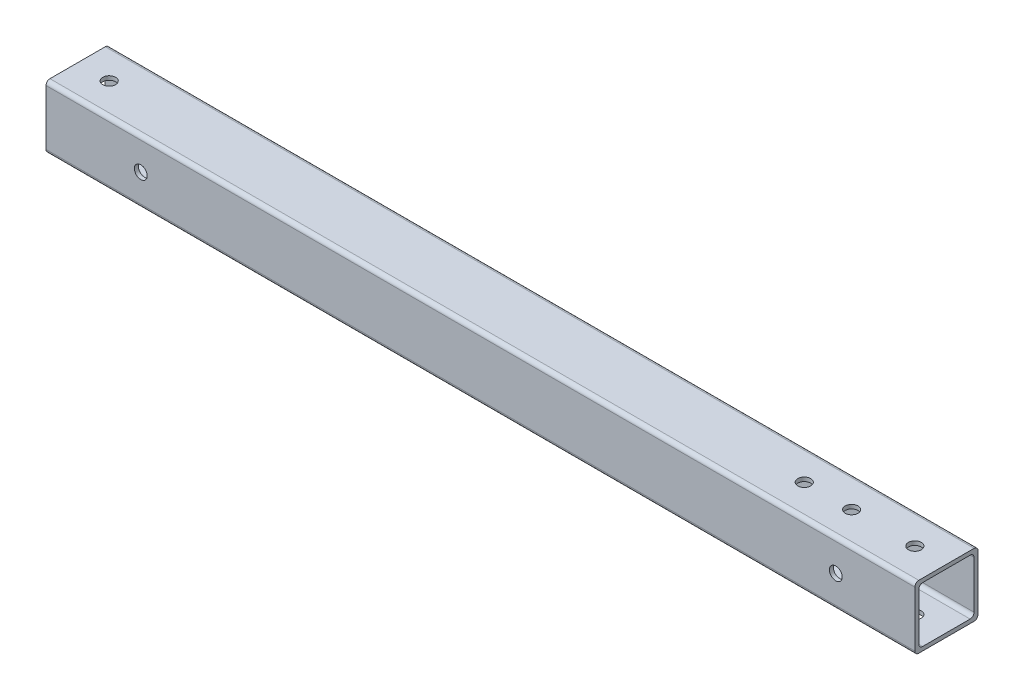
ISO-10303-21;
HEADER;
FILE_DESCRIPTION(('STEP AP214'),'2;1');
FILE_NAME('part.step','',(''),(''),'','','');
FILE_SCHEMA(('AUTOMOTIVE_DESIGN { 1 0 10303 214 1 1 1 1 }'));
ENDSEC;
DATA;
#1=APPLICATION_CONTEXT('core data for automotive mechanical design processes');
#2=APPLICATION_PROTOCOL_DEFINITION('international standard','automotive_design',2000,#1);
#3=PRODUCT_CONTEXT('',#1,'mechanical');
#4=PRODUCT('Part','Part','',(#3));
#5=PRODUCT_RELATED_PRODUCT_CATEGORY('part','',(#4));
#6=PRODUCT_DEFINITION_FORMATION('','',#4);
#7=PRODUCT_DEFINITION_CONTEXT('part definition',#1,'design');
#8=PRODUCT_DEFINITION('design','',#6,#7);
#9=PRODUCT_DEFINITION_SHAPE('','',#8);
#10=(LENGTH_UNIT() NAMED_UNIT(*) SI_UNIT(.MILLI.,.METRE.));
#11=(NAMED_UNIT(*) PLANE_ANGLE_UNIT() SI_UNIT($,.RADIAN.));
#12=(NAMED_UNIT(*) SI_UNIT($,.STERADIAN.) SOLID_ANGLE_UNIT());
#13=UNCERTAINTY_MEASURE_WITH_UNIT(LENGTH_MEASURE(1.E-05),#10,'distance_accuracy_value','');
#14=(GEOMETRIC_REPRESENTATION_CONTEXT(3) GLOBAL_UNCERTAINTY_ASSIGNED_CONTEXT((#13)) GLOBAL_UNIT_ASSIGNED_CONTEXT((#10,
#11,#12)) REPRESENTATION_CONTEXT('',''));
#15=CARTESIAN_POINT('',(0.,0.,0.));
#16=DIRECTION('',(0.,0.,1.));
#17=DIRECTION('',(1.,0.,0.));
#18=AXIS2_PLACEMENT_3D('',#15,#16,#17);
#19=CARTESIAN_POINT('',(0.,101.6,0.));
#20=DIRECTION('',(-1.,0.,0.));
#21=DIRECTION('',(0.,0.,1.));
#22=AXIS2_PLACEMENT_3D('',#19,#20,#21);
#23=PLANE('',#22);
#24=DIRECTION('',(0.,0.,1.));
#25=VECTOR('',#24,1.);
#26=CARTESIAN_POINT('',(0.,95.25,6.35000000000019));
#27=LINE('',#26,#25);
#28=CARTESIAN_POINT('',(0.,95.25,12.7000000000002));
#29=VERTEX_POINT('',#28);
#30=CARTESIAN_POINT('',(0.,95.25,88.9000000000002));
#31=VERTEX_POINT('',#30);
#32=EDGE_CURVE('E169',#29,#31,#27,.T.);
#33=ORIENTED_EDGE('',*,*,#32,.F.);
#34=CARTESIAN_POINT('',(0.,88.9,12.7000000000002));
#35=DIRECTION('',(-1.,0.,0.));
#36=DIRECTION('',(0.,0.,1.));
#37=AXIS2_PLACEMENT_3D('',#34,#35,#36);
#38=CIRCLE('',#37,6.35);
#39=CARTESIAN_POINT('',(0.,88.9,6.35000000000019));
#40=VERTEX_POINT('',#39);
#41=EDGE_CURVE('E179',#29,#40,#38,.T.);
#42=ORIENTED_EDGE('',*,*,#41,.T.);
#43=DIRECTION('',(0.,1.,0.));
#44=VECTOR('',#43,1.);
#45=CARTESIAN_POINT('',(0.,95.25,6.35000000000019));
#46=LINE('',#45,#44);
#47=CARTESIAN_POINT('',(0.,12.7,6.3500000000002));
#48=VERTEX_POINT('',#47);
#49=EDGE_CURVE('E252',#48,#40,#46,.T.);
#50=ORIENTED_EDGE('',*,*,#49,.F.);
#51=CARTESIAN_POINT('',(0.,12.7,12.7000000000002));
#52=DIRECTION('',(-1.,0.,0.));
#53=DIRECTION('',(0.,0.,1.));
#54=AXIS2_PLACEMENT_3D('',#51,#52,#53);
#55=CIRCLE('',#54,6.35);
#56=CARTESIAN_POINT('',(0.,6.35,12.7000000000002));
#57=VERTEX_POINT('',#56);
#58=EDGE_CURVE('E11',#48,#57,#55,.T.);
#59=ORIENTED_EDGE('',*,*,#58,.T.);
#60=DIRECTION('',(0.,0.,-1.));
#61=VECTOR('',#60,1.);
#62=CARTESIAN_POINT('',(0.,6.35,6.35000000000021));
#63=LINE('',#62,#61);
#64=CARTESIAN_POINT('',(0.,6.35,88.9000000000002));
#65=VERTEX_POINT('',#64);
#66=EDGE_CURVE('E265',#65,#57,#63,.T.);
#67=ORIENTED_EDGE('',*,*,#66,.F.);
#68=CARTESIAN_POINT('',(0.,12.7,88.9000000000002));
#69=DIRECTION('',(-1.,0.,0.));
#70=DIRECTION('',(0.,0.,1.));
#71=AXIS2_PLACEMENT_3D('',#68,#69,#70);
#72=CIRCLE('',#71,6.35);
#73=CARTESIAN_POINT('',(0.,12.7,95.2500000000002));
#74=VERTEX_POINT('',#73);
#75=EDGE_CURVE('E168',#65,#74,#72,.T.);
#76=ORIENTED_EDGE('',*,*,#75,.T.);
#77=DIRECTION('',(0.,-1.,0.));
#78=VECTOR('',#77,1.);
#79=CARTESIAN_POINT('',(0.,95.25,95.2500000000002));
#80=LINE('',#79,#78);
#81=CARTESIAN_POINT('',(0.,88.9,95.2500000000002));
#82=VERTEX_POINT('',#81);
#83=EDGE_CURVE('E152',#82,#74,#80,.T.);
#84=ORIENTED_EDGE('',*,*,#83,.F.);
#85=CARTESIAN_POINT('',(0.,88.9,88.9000000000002));
#86=DIRECTION('',(-1.,0.,0.));
#87=DIRECTION('',(0.,0.,1.));
#88=AXIS2_PLACEMENT_3D('',#85,#86,#87);
#89=CIRCLE('',#88,6.35);
#90=EDGE_CURVE('E164',#82,#31,#89,.T.);
#91=ORIENTED_EDGE('',*,*,#90,.T.);
#92=EDGE_LOOP('',(#33,#42,#50,#59,#67,#76,#84,#91));
#93=FACE_BOUND('',#92,.T.);
#94=DIRECTION('',(0.,-1.,0.));
#95=VECTOR('',#94,1.);
#96=CARTESIAN_POINT('',(0.,101.6,101.6));
#97=LINE('',#96,#95);
#98=CARTESIAN_POINT('',(0.,95.25,101.6));
#99=VERTEX_POINT('',#98);
#100=CARTESIAN_POINT('',(0.,6.34999999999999,101.6));
#101=VERTEX_POINT('',#100);
#102=EDGE_CURVE('E276',#99,#101,#97,.T.);
#103=ORIENTED_EDGE('',*,*,#102,.T.);
#104=CARTESIAN_POINT('',(0.,6.34999999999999,95.25));
#105=DIRECTION('',(-1.,0.,0.));
#106=DIRECTION('',(0.,0.,1.));
#107=AXIS2_PLACEMENT_3D('',#104,#105,#106);
#108=CIRCLE('',#107,6.35);
#109=CARTESIAN_POINT('',(0.,0.,95.25));
#110=VERTEX_POINT('',#109);
#111=EDGE_CURVE('E307',#101,#110,#108,.F.);
#112=ORIENTED_EDGE('',*,*,#111,.T.);
#113=DIRECTION('',(0.,0.,-1.));
#114=VECTOR('',#113,1.);
#115=CARTESIAN_POINT('',(0.,0.,0.));
#116=LINE('',#115,#114);
#117=CARTESIAN_POINT('',(0.,0.,6.35));
#118=VERTEX_POINT('',#117);
#119=EDGE_CURVE('E268',#110,#118,#116,.T.);
#120=ORIENTED_EDGE('',*,*,#119,.T.);
#121=CARTESIAN_POINT('',(0.,6.34999999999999,6.35));
#122=DIRECTION('',(-1.,0.,0.));
#123=DIRECTION('',(0.,0.,1.));
#124=AXIS2_PLACEMENT_3D('',#121,#122,#123);
#125=CIRCLE('',#124,6.35);
#126=CARTESIAN_POINT('',(0.,6.34999999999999,0.));
#127=VERTEX_POINT('',#126);
#128=EDGE_CURVE('E301',#118,#127,#125,.F.);
#129=ORIENTED_EDGE('',*,*,#128,.T.);
#130=DIRECTION('',(0.,-1.,0.));
#131=VECTOR('',#130,1.);
#132=CARTESIAN_POINT('',(0.,101.6,0.));
#133=LINE('',#132,#131);
#134=CARTESIAN_POINT('',(0.,95.25,0.));
#135=VERTEX_POINT('',#134);
#136=EDGE_CURVE('E159',#135,#127,#133,.T.);
#137=ORIENTED_EDGE('',*,*,#136,.F.);
#138=CARTESIAN_POINT('',(0.,95.25,6.35));
#139=DIRECTION('',(-1.,0.,0.));
#140=DIRECTION('',(0.,0.,1.));
#141=AXIS2_PLACEMENT_3D('',#138,#139,#140);
#142=CIRCLE('',#141,6.35);
#143=CARTESIAN_POINT('',(0.,101.6,6.35));
#144=VERTEX_POINT('',#143);
#145=EDGE_CURVE('E303',#135,#144,#142,.F.);
#146=ORIENTED_EDGE('',*,*,#145,.T.);
#147=DIRECTION('',(0.,0.,-1.));
#148=VECTOR('',#147,1.);
#149=CARTESIAN_POINT('',(0.,101.6,0.));
#150=LINE('',#149,#148);
#151=CARTESIAN_POINT('',(0.,101.6,95.25));
#152=VERTEX_POINT('',#151);
#153=EDGE_CURVE('E269',#152,#144,#150,.T.);
#154=ORIENTED_EDGE('',*,*,#153,.F.);
#155=CARTESIAN_POINT('',(0.,95.25,95.25));
#156=DIRECTION('',(-1.,0.,0.));
#157=DIRECTION('',(0.,0.,1.));
#158=AXIS2_PLACEMENT_3D('',#155,#156,#157);
#159=CIRCLE('',#158,6.35);
#160=EDGE_CURVE('E305',#152,#99,#159,.F.);
#161=ORIENTED_EDGE('',*,*,#160,.T.);
#162=EDGE_LOOP('',(#103,#112,#120,#129,#137,#146,#154,#161));
#163=FACE_BOUND('',#162,.T.);
#164=ADVANCED_FACE('F31',(#93,#163),#23,.F.);
#165=CARTESIAN_POINT('',(0.,101.6,0.));
#166=DIRECTION('',(0.,0.,1.));
#167=DIRECTION('',(1.,0.,0.));
#168=AXIS2_PLACEMENT_3D('',#165,#166,#167);
#169=PLANE('',#168);
#170=CARTESIAN_POINT('',(-127.,50.8,0.));
#171=DIRECTION('',(0.,0.,-1.));
#172=DIRECTION('',(-1.,0.,0.));
#173=AXIS2_PLACEMENT_3D('',#170,#171,#172);
#174=CIRCLE('',#173,10.31875);
#175=CARTESIAN_POINT('',(-137.31875,50.8,0.));
#176=VERTEX_POINT('',#175);
#177=EDGE_CURVE('E230',#176,#176,#174,.T.);
#178=ORIENTED_EDGE('',*,*,#177,.F.);
#179=EDGE_LOOP('',(#178));
#180=FACE_BOUND('',#179,.T.);
#181=CARTESIAN_POINT('',(-1244.6,50.8,1.52414506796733E-13));
#182=DIRECTION('',(0.,0.,-1.));
#183=DIRECTION('',(-1.,0.,0.));
#184=AXIS2_PLACEMENT_3D('',#181,#182,#183);
#185=CIRCLE('',#184,10.31875);
#186=CARTESIAN_POINT('',(-1254.91875,50.8,1.53678147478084E-13));
#187=VERTEX_POINT('',#186);
#188=EDGE_CURVE('E237',#187,#187,#185,.T.);
#189=ORIENTED_EDGE('',*,*,#188,.F.);
#190=EDGE_LOOP('',(#189));
#191=FACE_BOUND('',#190,.T.);
#192=DIRECTION('',(0.,-1.,0.));
#193=VECTOR('',#192,1.);
#194=CARTESIAN_POINT('',(-1397.,101.6,1.71077507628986E-13));
#195=LINE('',#194,#193);
#196=CARTESIAN_POINT('',(-1397.,95.25,1.71077507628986E-13));
#197=VERTEX_POINT('',#196);
#198=CARTESIAN_POINT('',(-1397.,6.34999999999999,1.71077507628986E-13));
#199=VERTEX_POINT('',#198);
#200=EDGE_CURVE('E286',#197,#199,#195,.T.);
#201=ORIENTED_EDGE('',*,*,#200,.F.);
#202=DIRECTION('',(-1.,0.,0.));
#203=VECTOR('',#202,1.);
#204=CARTESIAN_POINT('',(0.,95.25,0.));
#205=LINE('',#204,#203);
#206=EDGE_CURVE('E335',#197,#135,#205,.F.);
#207=ORIENTED_EDGE('',*,*,#206,.T.);
#208=ORIENTED_EDGE('',*,*,#136,.T.);
#209=DIRECTION('',(-1.,0.,0.));
#210=VECTOR('',#209,1.);
#211=CARTESIAN_POINT('',(-1397.,6.34999999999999,1.71077507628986E-13));
#212=LINE('',#211,#210);
#213=EDGE_CURVE('E333',#127,#199,#212,.T.);
#214=ORIENTED_EDGE('',*,*,#213,.T.);
#215=EDGE_LOOP('',(#201,#207,#208,#214));
#216=FACE_BOUND('',#215,.T.);
#217=ADVANCED_FACE('F361',(#180,#191,#216),#169,.F.);
#218=CARTESIAN_POINT('',(-1397.,101.6,1.71077507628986E-13));
#219=DIRECTION('',(1.,0.,0.));
#220=DIRECTION('',(0.,0.,-1.));
#221=AXIS2_PLACEMENT_3D('',#218,#219,#220);
#222=PLANE('',#221);
#223=DIRECTION('',(0.,0.,1.));
#224=VECTOR('',#223,1.);
#225=CARTESIAN_POINT('',(-1397.,6.35,6.35000000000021));
#226=LINE('',#225,#224);
#227=CARTESIAN_POINT('',(-1397.,6.35,12.7000000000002));
#228=VERTEX_POINT('',#227);
#229=CARTESIAN_POINT('',(-1397.,6.35,88.9000000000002));
#230=VERTEX_POINT('',#229);
#231=EDGE_CURVE('E258',#228,#230,#226,.T.);
#232=ORIENTED_EDGE('',*,*,#231,.F.);
#233=CARTESIAN_POINT('',(-1397.,12.7,12.7000000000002));
#234=DIRECTION('',(1.,0.,0.));
#235=DIRECTION('',(0.,0.,-1.));
#236=AXIS2_PLACEMENT_3D('',#233,#234,#235);
#237=CIRCLE('',#236,6.35);
#238=CARTESIAN_POINT('',(-1397.,12.7,6.3500000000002));
#239=VERTEX_POINT('',#238);
#240=EDGE_CURVE('E40',#228,#239,#237,.T.);
#241=ORIENTED_EDGE('',*,*,#240,.T.);
#242=DIRECTION('',(0.,-1.,0.));
#243=VECTOR('',#242,1.);
#244=CARTESIAN_POINT('',(-1397.,95.25,6.35000000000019));
#245=LINE('',#244,#243);
#246=CARTESIAN_POINT('',(-1397.,88.9,6.35000000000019));
#247=VERTEX_POINT('',#246);
#248=EDGE_CURVE('E255',#247,#239,#245,.T.);
#249=ORIENTED_EDGE('',*,*,#248,.F.);
#250=CARTESIAN_POINT('',(-1397.,88.9,12.7000000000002));
#251=DIRECTION('',(1.,0.,0.));
#252=DIRECTION('',(0.,0.,-1.));
#253=AXIS2_PLACEMENT_3D('',#250,#251,#252);
#254=CIRCLE('',#253,6.35);
#255=CARTESIAN_POINT('',(-1397.,95.25,12.7000000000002));
#256=VERTEX_POINT('',#255);
#257=EDGE_CURVE('E176',#247,#256,#254,.T.);
#258=ORIENTED_EDGE('',*,*,#257,.T.);
#259=DIRECTION('',(0.,0.,-1.));
#260=VECTOR('',#259,1.);
#261=CARTESIAN_POINT('',(-1397.,95.25,6.35000000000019));
#262=LINE('',#261,#260);
#263=CARTESIAN_POINT('',(-1397.,95.25,88.9000000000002));
#264=VERTEX_POINT('',#263);
#265=EDGE_CURVE('E262',#264,#256,#262,.T.);
#266=ORIENTED_EDGE('',*,*,#265,.F.);
#267=CARTESIAN_POINT('',(-1397.,88.9,88.9000000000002));
#268=DIRECTION('',(1.,0.,0.));
#269=DIRECTION('',(0.,0.,-1.));
#270=AXIS2_PLACEMENT_3D('',#267,#268,#269);
#271=CIRCLE('',#270,6.35);
#272=CARTESIAN_POINT('',(-1397.,88.9,95.2500000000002));
#273=VERTEX_POINT('',#272);
#274=EDGE_CURVE('E177',#264,#273,#271,.T.);
#275=ORIENTED_EDGE('',*,*,#274,.T.);
#276=DIRECTION('',(0.,1.,0.));
#277=VECTOR('',#276,1.);
#278=CARTESIAN_POINT('',(-1397.,95.25,95.2500000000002));
#279=LINE('',#278,#277);
#280=CARTESIAN_POINT('',(-1397.,12.7,95.2500000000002));
#281=VERTEX_POINT('',#280);
#282=EDGE_CURVE('E155',#281,#273,#279,.T.);
#283=ORIENTED_EDGE('',*,*,#282,.F.);
#284=CARTESIAN_POINT('',(-1397.,12.7,88.9000000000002));
#285=DIRECTION('',(1.,0.,0.));
#286=DIRECTION('',(0.,0.,-1.));
#287=AXIS2_PLACEMENT_3D('',#284,#285,#286);
#288=CIRCLE('',#287,6.35);
#289=EDGE_CURVE('E337',#281,#230,#288,.T.);
#290=ORIENTED_EDGE('',*,*,#289,.T.);
#291=EDGE_LOOP('',(#232,#241,#249,#258,#266,#275,#283,#290));
#292=FACE_BOUND('',#291,.T.);
#293=DIRECTION('',(0.,0.,1.));
#294=VECTOR('',#293,1.);
#295=CARTESIAN_POINT('',(-1397.,0.,1.71077507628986E-13));
#296=LINE('',#295,#294);
#297=CARTESIAN_POINT('',(-1397.,0.,6.35000000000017));
#298=VERTEX_POINT('',#297);
#299=CARTESIAN_POINT('',(-1397.,0.,95.2500000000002));
#300=VERTEX_POINT('',#299);
#301=EDGE_CURVE('E273',#298,#300,#296,.T.);
#302=ORIENTED_EDGE('',*,*,#301,.T.);
#303=CARTESIAN_POINT('',(-1397.,6.34999999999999,95.2500000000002));
#304=DIRECTION('',(1.,0.,0.));
#305=DIRECTION('',(0.,0.,-1.));
#306=AXIS2_PLACEMENT_3D('',#303,#304,#305);
#307=CIRCLE('',#306,6.35);
#308=CARTESIAN_POINT('',(-1397.,6.34999999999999,101.6));
#309=VERTEX_POINT('',#308);
#310=EDGE_CURVE('E317',#300,#309,#307,.F.);
#311=ORIENTED_EDGE('',*,*,#310,.T.);
#312=DIRECTION('',(0.,-1.,0.));
#313=VECTOR('',#312,1.);
#314=CARTESIAN_POINT('',(-1397.,101.6,101.6));
#315=LINE('',#314,#313);
#316=CARTESIAN_POINT('',(-1397.,95.25,101.6));
#317=VERTEX_POINT('',#316);
#318=EDGE_CURVE('E283',#317,#309,#315,.T.);
#319=ORIENTED_EDGE('',*,*,#318,.F.);
#320=CARTESIAN_POINT('',(-1397.,95.25,95.2500000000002));
#321=DIRECTION('',(1.,0.,0.));
#322=DIRECTION('',(0.,0.,-1.));
#323=AXIS2_PLACEMENT_3D('',#320,#321,#322);
#324=CIRCLE('',#323,6.35);
#325=CARTESIAN_POINT('',(-1397.,101.6,95.2500000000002));
#326=VERTEX_POINT('',#325);
#327=EDGE_CURVE('E315',#317,#326,#324,.F.);
#328=ORIENTED_EDGE('',*,*,#327,.T.);
#329=DIRECTION('',(0.,0.,1.));
#330=VECTOR('',#329,1.);
#331=CARTESIAN_POINT('',(-1397.,101.6,1.71077507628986E-13));
#332=LINE('',#331,#330);
#333=CARTESIAN_POINT('',(-1397.,101.6,6.35000000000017));
#334=VERTEX_POINT('',#333);
#335=EDGE_CURVE('E272',#334,#326,#332,.T.);
#336=ORIENTED_EDGE('',*,*,#335,.F.);
#337=CARTESIAN_POINT('',(-1397.,95.25,6.35000000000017));
#338=DIRECTION('',(1.,0.,0.));
#339=DIRECTION('',(0.,0.,-1.));
#340=AXIS2_PLACEMENT_3D('',#337,#338,#339);
#341=CIRCLE('',#340,6.35);
#342=EDGE_CURVE('E56',#334,#197,#341,.F.);
#343=ORIENTED_EDGE('',*,*,#342,.T.);
#344=ORIENTED_EDGE('',*,*,#200,.T.);
#345=CARTESIAN_POINT('',(-1397.,6.34999999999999,6.35000000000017));
#346=DIRECTION('',(1.,0.,0.));
#347=DIRECTION('',(0.,0.,-1.));
#348=AXIS2_PLACEMENT_3D('',#345,#346,#347);
#349=CIRCLE('',#348,6.35);
#350=EDGE_CURVE('E48',#199,#298,#349,.F.);
#351=ORIENTED_EDGE('',*,*,#350,.T.);
#352=EDGE_LOOP('',(#302,#311,#319,#328,#336,#343,#344,#351));
#353=FACE_BOUND('',#352,.T.);
#354=ADVANCED_FACE('F340',(#292,#353),#222,.F.);
#355=CARTESIAN_POINT('',(0.,101.6,101.6));
#356=DIRECTION('',(0.,0.,-1.));
#357=DIRECTION('',(-1.,0.,0.));
#358=AXIS2_PLACEMENT_3D('',#355,#356,#357);
#359=PLANE('',#358);
#360=CARTESIAN_POINT('',(-127.,50.8,101.6));
#361=DIRECTION('',(0.,0.,-1.));
#362=DIRECTION('',(-1.,0.,0.));
#363=AXIS2_PLACEMENT_3D('',#360,#361,#362);
#364=CIRCLE('',#363,10.31875);
#365=CARTESIAN_POINT('',(-137.31875,50.8,101.6));
#366=VERTEX_POINT('',#365);
#367=EDGE_CURVE('E199',#366,#366,#364,.T.);
#368=ORIENTED_EDGE('',*,*,#367,.T.);
#369=EDGE_LOOP('',(#368));
#370=FACE_BOUND('',#369,.T.);
#371=CARTESIAN_POINT('',(-1244.6,50.8,101.6));
#372=DIRECTION('',(0.,0.,-1.));
#373=DIRECTION('',(-1.,0.,0.));
#374=AXIS2_PLACEMENT_3D('',#371,#372,#373);
#375=CIRCLE('',#374,10.31875);
#376=CARTESIAN_POINT('',(-1254.91875,50.8,101.6));
#377=VERTEX_POINT('',#376);
#378=EDGE_CURVE('E194',#377,#377,#375,.T.);
#379=ORIENTED_EDGE('',*,*,#378,.T.);
#380=EDGE_LOOP('',(#379));
#381=FACE_BOUND('',#380,.T.);
#382=ORIENTED_EDGE('',*,*,#318,.T.);
#383=DIRECTION('',(1.,0.,0.));
#384=VECTOR('',#383,1.);
#385=CARTESIAN_POINT('',(0.,6.34999999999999,101.6));
#386=LINE('',#385,#384);
#387=EDGE_CURVE('E298',#309,#101,#386,.T.);
#388=ORIENTED_EDGE('',*,*,#387,.T.);
#389=ORIENTED_EDGE('',*,*,#102,.F.);
#390=DIRECTION('',(1.,0.,0.));
#391=VECTOR('',#390,1.);
#392=CARTESIAN_POINT('',(0.,95.25,101.6));
#393=LINE('',#392,#391);
#394=EDGE_CURVE('E296',#99,#317,#393,.F.);
#395=ORIENTED_EDGE('',*,*,#394,.T.);
#396=EDGE_LOOP('',(#382,#388,#389,#395));
#397=FACE_BOUND('',#396,.T.);
#398=ADVANCED_FACE('F370',(#370,#381,#397),#359,.F.);
#399=CARTESIAN_POINT('',(0.,101.6,0.));
#400=DIRECTION('',(0.,-1.,0.));
#401=DIRECTION('',(0.,0.,-1.));
#402=AXIS2_PLACEMENT_3D('',#399,#400,#401);
#403=PLANE('',#402);
#404=CARTESIAN_POINT('',(-228.6,101.6,50.8));
#405=DIRECTION('',(0.,-1.,0.));
#406=DIRECTION('',(0.,0.,-1.));
#407=AXIS2_PLACEMENT_3D('',#404,#405,#406);
#408=CIRCLE('',#407,10.31875);
#409=CARTESIAN_POINT('',(-228.6,101.6,40.48125));
#410=VERTEX_POINT('',#409);
#411=EDGE_CURVE('E429',#410,#410,#408,.T.);
#412=ORIENTED_EDGE('',*,*,#411,.T.);
#413=EDGE_LOOP('',(#412));
#414=FACE_BOUND('',#413,.T.);
#415=CARTESIAN_POINT('',(-152.4,101.6,50.8));
#416=DIRECTION('',(0.,-1.,0.));
#417=DIRECTION('',(0.,0.,-1.));
#418=AXIS2_PLACEMENT_3D('',#415,#416,#417);
#419=CIRCLE('',#418,10.31875);
#420=CARTESIAN_POINT('',(-152.4,101.6,40.48125));
#421=VERTEX_POINT('',#420);
#422=EDGE_CURVE('E207',#421,#421,#419,.T.);
#423=ORIENTED_EDGE('',*,*,#422,.T.);
#424=EDGE_LOOP('',(#423));
#425=FACE_BOUND('',#424,.T.);
#426=CARTESIAN_POINT('',(-50.8,101.6,50.8));
#427=DIRECTION('',(0.,-1.,0.));
#428=DIRECTION('',(0.,0.,-1.));
#429=AXIS2_PLACEMENT_3D('',#426,#427,#428);
#430=CIRCLE('',#429,10.31875);
#431=CARTESIAN_POINT('',(-50.8,101.6,40.48125));
#432=VERTEX_POINT('',#431);
#433=EDGE_CURVE('E203',#432,#432,#430,.T.);
#434=ORIENTED_EDGE('',*,*,#433,.T.);
#435=EDGE_LOOP('',(#434));
#436=FACE_BOUND('',#435,.T.);
#437=CARTESIAN_POINT('',(-1346.2,101.6,50.8));
#438=DIRECTION('',(0.,-1.,0.));
#439=DIRECTION('',(0.,0.,-1.));
#440=AXIS2_PLACEMENT_3D('',#437,#438,#439);
#441=CIRCLE('',#440,10.31875);
#442=CARTESIAN_POINT('',(-1346.2,101.6,40.48125));
#443=VERTEX_POINT('',#442);
#444=EDGE_CURVE('E189',#443,#443,#441,.T.);
#445=ORIENTED_EDGE('',*,*,#444,.T.);
#446=EDGE_LOOP('',(#445));
#447=FACE_BOUND('',#446,.T.);
#448=ORIENTED_EDGE('',*,*,#335,.T.);
#449=DIRECTION('',(1.,0.,0.));
#450=VECTOR('',#449,1.);
#451=CARTESIAN_POINT('',(0.,101.6,95.25));
#452=LINE('',#451,#450);
#453=EDGE_CURVE('E322',#326,#152,#452,.T.);
#454=ORIENTED_EDGE('',*,*,#453,.T.);
#455=ORIENTED_EDGE('',*,*,#153,.T.);
#456=DIRECTION('',(-1.,0.,0.));
#457=VECTOR('',#456,1.);
#458=CARTESIAN_POINT('',(0.,101.6,6.35));
#459=LINE('',#458,#457);
#460=EDGE_CURVE('E319',#144,#334,#459,.T.);
#461=ORIENTED_EDGE('',*,*,#460,.T.);
#462=EDGE_LOOP('',(#448,#454,#455,#461));
#463=FACE_BOUND('',#462,.T.);
#464=ADVANCED_FACE('F373',(#414,#425,#436,#447,#463),#403,.F.);
#465=CARTESIAN_POINT('',(0.,0.,0.));
#466=DIRECTION('',(0.,-1.,0.));
#467=DIRECTION('',(0.,0.,-1.));
#468=AXIS2_PLACEMENT_3D('',#465,#466,#467);
#469=PLANE('',#468);
#470=CARTESIAN_POINT('',(-228.6,0.,50.8));
#471=DIRECTION('',(0.,-1.,0.));
#472=DIRECTION('',(0.,0.,-1.));
#473=AXIS2_PLACEMENT_3D('',#470,#471,#472);
#474=CIRCLE('',#473,10.31875);
#475=CARTESIAN_POINT('',(-228.6,0.,40.48125));
#476=VERTEX_POINT('',#475);
#477=EDGE_CURVE('E434',#476,#476,#474,.T.);
#478=ORIENTED_EDGE('',*,*,#477,.F.);
#479=EDGE_LOOP('',(#478));
#480=FACE_BOUND('',#479,.T.);
#481=CARTESIAN_POINT('',(-152.4,0.,50.8));
#482=DIRECTION('',(0.,-1.,0.));
#483=DIRECTION('',(0.,0.,-1.));
#484=AXIS2_PLACEMENT_3D('',#481,#482,#483);
#485=CIRCLE('',#484,10.31875);
#486=CARTESIAN_POINT('',(-152.4,0.,40.48125));
#487=VERTEX_POINT('',#486);
#488=EDGE_CURVE('E214',#487,#487,#485,.T.);
#489=ORIENTED_EDGE('',*,*,#488,.F.);
#490=EDGE_LOOP('',(#489));
#491=FACE_BOUND('',#490,.T.);
#492=CARTESIAN_POINT('',(-50.8,0.,50.8));
#493=DIRECTION('',(0.,-1.,0.));
#494=DIRECTION('',(0.,0.,-1.));
#495=AXIS2_PLACEMENT_3D('',#492,#493,#494);
#496=CIRCLE('',#495,10.31875);
#497=CARTESIAN_POINT('',(-50.8,0.,40.48125));
#498=VERTEX_POINT('',#497);
#499=EDGE_CURVE('E211',#498,#498,#496,.T.);
#500=ORIENTED_EDGE('',*,*,#499,.F.);
#501=EDGE_LOOP('',(#500));
#502=FACE_BOUND('',#501,.T.);
#503=CARTESIAN_POINT('',(-1346.2,0.,50.8));
#504=DIRECTION('',(0.,-1.,0.));
#505=DIRECTION('',(0.,0.,-1.));
#506=AXIS2_PLACEMENT_3D('',#503,#504,#505);
#507=CIRCLE('',#506,10.31875);
#508=CARTESIAN_POINT('',(-1346.2,0.,40.48125));
#509=VERTEX_POINT('',#508);
#510=EDGE_CURVE('E244',#509,#509,#507,.T.);
#511=ORIENTED_EDGE('',*,*,#510,.F.);
#512=EDGE_LOOP('',(#511));
#513=FACE_BOUND('',#512,.T.);
#514=ORIENTED_EDGE('',*,*,#119,.F.);
#515=DIRECTION('',(1.,0.,0.));
#516=VECTOR('',#515,1.);
#517=CARTESIAN_POINT('',(-1397.,0.,95.2500000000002));
#518=LINE('',#517,#516);
#519=EDGE_CURVE('E311',#110,#300,#518,.F.);
#520=ORIENTED_EDGE('',*,*,#519,.T.);
#521=ORIENTED_EDGE('',*,*,#301,.F.);
#522=DIRECTION('',(-1.,0.,0.));
#523=VECTOR('',#522,1.);
#524=CARTESIAN_POINT('',(0.,0.,6.35));
#525=LINE('',#524,#523);
#526=EDGE_CURVE('E309',#298,#118,#525,.F.);
#527=ORIENTED_EDGE('',*,*,#526,.T.);
#528=EDGE_LOOP('',(#514,#520,#521,#527));
#529=FACE_BOUND('',#528,.T.);
#530=ADVANCED_FACE('F375',(#480,#491,#502,#513,#529),#469,.T.);
#531=CARTESIAN_POINT('',(0.000999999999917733,95.25,6.35000000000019));
#532=DIRECTION('',(0.,0.,-1.));
#533=DIRECTION('',(0.,1.,0.));
#534=AXIS2_PLACEMENT_3D('',#531,#532,#533);
#535=PLANE('',#534);
#536=CARTESIAN_POINT('',(-127.,50.8,6.3500000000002));
#537=DIRECTION('',(0.,0.,-1.));
#538=DIRECTION('',(0.,1.,0.));
#539=AXIS2_PLACEMENT_3D('',#536,#537,#538);
#540=CIRCLE('',#539,10.31875);
#541=CARTESIAN_POINT('',(-127.,61.11875,6.3500000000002));
#542=VERTEX_POINT('',#541);
#543=EDGE_CURVE('E198',#542,#542,#540,.T.);
#544=ORIENTED_EDGE('',*,*,#543,.T.);
#545=EDGE_LOOP('',(#544));
#546=FACE_BOUND('',#545,.T.);
#547=CARTESIAN_POINT('',(-1244.6,50.8,6.3500000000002));
#548=DIRECTION('',(0.,0.,-1.));
#549=DIRECTION('',(0.,1.,0.));
#550=AXIS2_PLACEMENT_3D('',#547,#548,#549);
#551=CIRCLE('',#550,10.31875);
#552=CARTESIAN_POINT('',(-1244.6,61.11875,6.3500000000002));
#553=VERTEX_POINT('',#552);
#554=EDGE_CURVE('E193',#553,#553,#551,.T.);
#555=ORIENTED_EDGE('',*,*,#554,.T.);
#556=EDGE_LOOP('',(#555));
#557=FACE_BOUND('',#556,.T.);
#558=ORIENTED_EDGE('',*,*,#49,.T.);
#559=DIRECTION('',(-1.,0.,0.));
#560=VECTOR('',#559,1.);
#561=CARTESIAN_POINT('',(-1397.,88.9,6.35000000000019));
#562=LINE('',#561,#560);
#563=EDGE_CURVE('E330',#40,#247,#562,.T.);
#564=ORIENTED_EDGE('',*,*,#563,.T.);
#565=ORIENTED_EDGE('',*,*,#248,.T.);
#566=DIRECTION('',(-1.,0.,0.));
#567=VECTOR('',#566,1.);
#568=CARTESIAN_POINT('',(0.,12.7,6.3500000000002));
#569=LINE('',#568,#567);
#570=EDGE_CURVE('E328',#239,#48,#569,.F.);
#571=ORIENTED_EDGE('',*,*,#570,.T.);
#572=EDGE_LOOP('',(#558,#564,#565,#571));
#573=FACE_BOUND('',#572,.T.);
#574=ADVANCED_FACE('F378',(#546,#557,#573),#535,.F.);
#575=CARTESIAN_POINT('',(0.000999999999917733,95.25,6.35000000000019));
#576=DIRECTION('',(0.,1.,0.));
#577=DIRECTION('',(0.,0.,1.));
#578=AXIS2_PLACEMENT_3D('',#575,#576,#577);
#579=PLANE('',#578);
#580=CARTESIAN_POINT('',(-228.6,95.25,50.8));
#581=DIRECTION('',(0.,1.,0.));
#582=DIRECTION('',(0.,0.,1.));
#583=AXIS2_PLACEMENT_3D('',#580,#581,#582);
#584=CIRCLE('',#583,10.31875);
#585=CARTESIAN_POINT('',(-228.6,95.25,61.11875));
#586=VERTEX_POINT('',#585);
#587=EDGE_CURVE('E219',#586,#586,#584,.T.);
#588=ORIENTED_EDGE('',*,*,#587,.T.);
#589=EDGE_LOOP('',(#588));
#590=FACE_BOUND('',#589,.T.);
#591=CARTESIAN_POINT('',(-152.4,95.25,50.8));
#592=DIRECTION('',(0.,1.,0.));
#593=DIRECTION('',(0.,0.,1.));
#594=AXIS2_PLACEMENT_3D('',#591,#592,#593);
#595=CIRCLE('',#594,10.31875);
#596=CARTESIAN_POINT('',(-152.4,95.25,61.11875));
#597=VERTEX_POINT('',#596);
#598=EDGE_CURVE('E206',#597,#597,#595,.T.);
#599=ORIENTED_EDGE('',*,*,#598,.T.);
#600=EDGE_LOOP('',(#599));
#601=FACE_BOUND('',#600,.T.);
#602=CARTESIAN_POINT('',(-50.8,95.25,50.8));
#603=DIRECTION('',(0.,1.,0.));
#604=DIRECTION('',(0.,0.,1.));
#605=AXIS2_PLACEMENT_3D('',#602,#603,#604);
#606=CIRCLE('',#605,10.31875);
#607=CARTESIAN_POINT('',(-50.8,95.25,61.11875));
#608=VERTEX_POINT('',#607);
#609=EDGE_CURVE('E202',#608,#608,#606,.T.);
#610=ORIENTED_EDGE('',*,*,#609,.T.);
#611=EDGE_LOOP('',(#610));
#612=FACE_BOUND('',#611,.T.);
#613=CARTESIAN_POINT('',(-1346.2,95.25,50.8));
#614=DIRECTION('',(0.,1.,0.));
#615=DIRECTION('',(0.,0.,1.));
#616=AXIS2_PLACEMENT_3D('',#613,#614,#615);
#617=CIRCLE('',#616,10.31875);
#618=CARTESIAN_POINT('',(-1346.2,95.25,61.11875));
#619=VERTEX_POINT('',#618);
#620=EDGE_CURVE('E170',#619,#619,#617,.T.);
#621=ORIENTED_EDGE('',*,*,#620,.T.);
#622=EDGE_LOOP('',(#621));
#623=FACE_BOUND('',#622,.T.);
#624=ORIENTED_EDGE('',*,*,#32,.T.);
#625=DIRECTION('',(-1.,0.,0.));
#626=VECTOR('',#625,1.);
#627=CARTESIAN_POINT('',(-1397.,95.25,88.9000000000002));
#628=LINE('',#627,#626);
#629=EDGE_CURVE('E175',#31,#264,#628,.T.);
#630=ORIENTED_EDGE('',*,*,#629,.T.);
#631=ORIENTED_EDGE('',*,*,#265,.T.);
#632=DIRECTION('',(-1.,0.,0.));
#633=VECTOR('',#632,1.);
#634=CARTESIAN_POINT('',(0.,95.25,12.7000000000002));
#635=LINE('',#634,#633);
#636=EDGE_CURVE('E325',#256,#29,#635,.F.);
#637=ORIENTED_EDGE('',*,*,#636,.T.);
#638=EDGE_LOOP('',(#624,#630,#631,#637));
#639=FACE_BOUND('',#638,.T.);
#640=ADVANCED_FACE('F384',(#590,#601,#612,#623,#639),#579,.F.);
#641=CARTESIAN_POINT('',(0.000999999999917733,95.25,95.2500000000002));
#642=DIRECTION('',(0.,0.,1.));
#643=DIRECTION('',(0.,-1.,0.));
#644=AXIS2_PLACEMENT_3D('',#641,#642,#643);
#645=PLANE('',#644);
#646=CARTESIAN_POINT('',(-127.,50.8,95.2500000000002));
#647=DIRECTION('',(0.,0.,1.));
#648=DIRECTION('',(0.,-1.,0.));
#649=AXIS2_PLACEMENT_3D('',#646,#647,#648);
#650=CIRCLE('',#649,10.31875);
#651=CARTESIAN_POINT('',(-127.,40.48125,95.2500000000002));
#652=VERTEX_POINT('',#651);
#653=EDGE_CURVE('E195',#652,#652,#650,.T.);
#654=ORIENTED_EDGE('',*,*,#653,.T.);
#655=EDGE_LOOP('',(#654));
#656=FACE_BOUND('',#655,.T.);
#657=CARTESIAN_POINT('',(-1244.6,50.8,95.2500000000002));
#658=DIRECTION('',(0.,0.,1.));
#659=DIRECTION('',(0.,-1.,0.));
#660=AXIS2_PLACEMENT_3D('',#657,#658,#659);
#661=CIRCLE('',#660,10.31875);
#662=CARTESIAN_POINT('',(-1244.6,40.48125,95.2500000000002));
#663=VERTEX_POINT('',#662);
#664=EDGE_CURVE('E190',#663,#663,#661,.T.);
#665=ORIENTED_EDGE('',*,*,#664,.T.);
#666=EDGE_LOOP('',(#665));
#667=FACE_BOUND('',#666,.T.);
#668=ORIENTED_EDGE('',*,*,#83,.T.);
#669=DIRECTION('',(-1.,0.,0.));
#670=VECTOR('',#669,1.);
#671=CARTESIAN_POINT('',(-1397.,12.7,95.2500000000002));
#672=LINE('',#671,#670);
#673=EDGE_CURVE('E158',#74,#281,#672,.T.);
#674=ORIENTED_EDGE('',*,*,#673,.T.);
#675=ORIENTED_EDGE('',*,*,#282,.T.);
#676=DIRECTION('',(-1.,0.,0.));
#677=VECTOR('',#676,1.);
#678=CARTESIAN_POINT('',(0.,88.9,95.2500000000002));
#679=LINE('',#678,#677);
#680=EDGE_CURVE('E148',#273,#82,#679,.F.);
#681=ORIENTED_EDGE('',*,*,#680,.T.);
#682=EDGE_LOOP('',(#668,#674,#675,#681));
#683=FACE_BOUND('',#682,.T.);
#684=ADVANCED_FACE('F150',(#656,#667,#683),#645,.F.);
#685=CARTESIAN_POINT('',(0.000999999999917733,6.35,6.35000000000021));
#686=DIRECTION('',(0.,-1.,0.));
#687=DIRECTION('',(0.,0.,-1.));
#688=AXIS2_PLACEMENT_3D('',#685,#686,#687);
#689=PLANE('',#688);
#690=CARTESIAN_POINT('',(-228.6,6.34999999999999,50.8));
#691=DIRECTION('',(0.,-1.,0.));
#692=DIRECTION('',(0.,0.,-1.));
#693=AXIS2_PLACEMENT_3D('',#690,#691,#692);
#694=CIRCLE('',#693,10.31875);
#695=CARTESIAN_POINT('',(-228.6,6.34999999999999,40.48125));
#696=VERTEX_POINT('',#695);
#697=EDGE_CURVE('E35',#696,#696,#694,.T.);
#698=ORIENTED_EDGE('',*,*,#697,.T.);
#699=EDGE_LOOP('',(#698));
#700=FACE_BOUND('',#699,.T.);
#701=CARTESIAN_POINT('',(-152.4,6.34999999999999,50.8));
#702=DIRECTION('',(0.,-1.,0.));
#703=DIRECTION('',(0.,0.,-1.));
#704=AXIS2_PLACEMENT_3D('',#701,#702,#703);
#705=CIRCLE('',#704,10.31875);
#706=CARTESIAN_POINT('',(-152.4,6.34999999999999,40.48125));
#707=VERTEX_POINT('',#706);
#708=EDGE_CURVE('E204',#707,#707,#705,.T.);
#709=ORIENTED_EDGE('',*,*,#708,.T.);
#710=EDGE_LOOP('',(#709));
#711=FACE_BOUND('',#710,.T.);
#712=CARTESIAN_POINT('',(-50.8,6.34999999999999,50.8));
#713=DIRECTION('',(0.,-1.,0.));
#714=DIRECTION('',(0.,0.,-1.));
#715=AXIS2_PLACEMENT_3D('',#712,#713,#714);
#716=CIRCLE('',#715,10.31875);
#717=CARTESIAN_POINT('',(-50.8,6.34999999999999,40.48125));
#718=VERTEX_POINT('',#717);
#719=EDGE_CURVE('E200',#718,#718,#716,.T.);
#720=ORIENTED_EDGE('',*,*,#719,.T.);
#721=EDGE_LOOP('',(#720));
#722=FACE_BOUND('',#721,.T.);
#723=CARTESIAN_POINT('',(-1346.2,6.34999999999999,50.8));
#724=DIRECTION('',(0.,-1.,0.));
#725=DIRECTION('',(0.,0.,-1.));
#726=AXIS2_PLACEMENT_3D('',#723,#724,#725);
#727=CIRCLE('',#726,10.31875);
#728=CARTESIAN_POINT('',(-1346.2,6.34999999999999,40.48125));
#729=VERTEX_POINT('',#728);
#730=EDGE_CURVE('E186',#729,#729,#727,.T.);
#731=ORIENTED_EDGE('',*,*,#730,.T.);
#732=EDGE_LOOP('',(#731));
#733=FACE_BOUND('',#732,.T.);
#734=ORIENTED_EDGE('',*,*,#231,.T.);
#735=DIRECTION('',(-1.,0.,0.));
#736=VECTOR('',#735,1.);
#737=CARTESIAN_POINT('',(0.,6.35,88.9000000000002));
#738=LINE('',#737,#736);
#739=EDGE_CURVE('E294',#230,#65,#738,.F.);
#740=ORIENTED_EDGE('',*,*,#739,.T.);
#741=ORIENTED_EDGE('',*,*,#66,.T.);
#742=DIRECTION('',(-1.,0.,0.));
#743=VECTOR('',#742,1.);
#744=CARTESIAN_POINT('',(-1397.,6.35,12.7000000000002));
#745=LINE('',#744,#743);
#746=EDGE_CURVE('E291',#57,#228,#745,.T.);
#747=ORIENTED_EDGE('',*,*,#746,.T.);
#748=EDGE_LOOP('',(#734,#740,#741,#747));
#749=FACE_BOUND('',#748,.T.);
#750=ADVANCED_FACE('F344',(#700,#711,#722,#733,#749),#689,.F.);
#751=CARTESIAN_POINT('',(0.000999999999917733,12.7,88.9000000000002));
#752=DIRECTION('',(1.,0.,0.));
#753=DIRECTION('',(0.,0.,-1.));
#754=AXIS2_PLACEMENT_3D('',#751,#752,#753);
#755=CYLINDRICAL_SURFACE('',#754,6.35);
#756=ORIENTED_EDGE('',*,*,#75,.F.);
#757=ORIENTED_EDGE('',*,*,#739,.F.);
#758=ORIENTED_EDGE('',*,*,#289,.F.);
#759=ORIENTED_EDGE('',*,*,#673,.F.);
#760=EDGE_LOOP('',(#756,#757,#758,#759));
#761=FACE_BOUND('',#760,.T.);
#762=ADVANCED_FACE('F346',(#761),#755,.F.);
#763=CARTESIAN_POINT('',(0.,6.34999999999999,95.25));
#764=DIRECTION('',(-1.,0.,0.));
#765=DIRECTION('',(0.,0.,1.));
#766=AXIS2_PLACEMENT_3D('',#763,#764,#765);
#767=CYLINDRICAL_SURFACE('',#766,6.35);
#768=ORIENTED_EDGE('',*,*,#310,.F.);
#769=ORIENTED_EDGE('',*,*,#519,.F.);
#770=ORIENTED_EDGE('',*,*,#111,.F.);
#771=ORIENTED_EDGE('',*,*,#387,.F.);
#772=EDGE_LOOP('',(#768,#769,#770,#771));
#773=FACE_BOUND('',#772,.T.);
#774=ADVANCED_FACE('F348',(#773),#767,.T.);
#775=CARTESIAN_POINT('',(0.,95.25,95.25));
#776=DIRECTION('',(1.,0.,0.));
#777=DIRECTION('',(0.,0.,-1.));
#778=AXIS2_PLACEMENT_3D('',#775,#776,#777);
#779=CYLINDRICAL_SURFACE('',#778,6.35);
#780=ORIENTED_EDGE('',*,*,#327,.F.);
#781=ORIENTED_EDGE('',*,*,#394,.F.);
#782=ORIENTED_EDGE('',*,*,#160,.F.);
#783=ORIENTED_EDGE('',*,*,#453,.F.);
#784=EDGE_LOOP('',(#780,#781,#782,#783));
#785=FACE_BOUND('',#784,.T.);
#786=ADVANCED_FACE('F354',(#785),#779,.T.);
#787=CARTESIAN_POINT('',(0.000999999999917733,88.9,88.9000000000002));
#788=DIRECTION('',(1.,0.,0.));
#789=DIRECTION('',(0.,0.,-1.));
#790=AXIS2_PLACEMENT_3D('',#787,#788,#789);
#791=CYLINDRICAL_SURFACE('',#790,6.35);
#792=ORIENTED_EDGE('',*,*,#90,.F.);
#793=ORIENTED_EDGE('',*,*,#680,.F.);
#794=ORIENTED_EDGE('',*,*,#274,.F.);
#795=ORIENTED_EDGE('',*,*,#629,.F.);
#796=EDGE_LOOP('',(#792,#793,#794,#795));
#797=FACE_BOUND('',#796,.T.);
#798=ADVANCED_FACE('F173',(#797),#791,.F.);
#799=CARTESIAN_POINT('',(0.000999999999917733,88.9,12.7000000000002));
#800=DIRECTION('',(1.,0.,0.));
#801=DIRECTION('',(0.,0.,-1.));
#802=AXIS2_PLACEMENT_3D('',#799,#800,#801);
#803=CYLINDRICAL_SURFACE('',#802,6.35);
#804=ORIENTED_EDGE('',*,*,#41,.F.);
#805=ORIENTED_EDGE('',*,*,#636,.F.);
#806=ORIENTED_EDGE('',*,*,#257,.F.);
#807=ORIENTED_EDGE('',*,*,#563,.F.);
#808=EDGE_LOOP('',(#804,#805,#806,#807));
#809=FACE_BOUND('',#808,.T.);
#810=ADVANCED_FACE('F479',(#809),#803,.F.);
#811=CARTESIAN_POINT('',(0.,95.25,6.35));
#812=DIRECTION('',(-1.,0.,0.));
#813=DIRECTION('',(0.,0.,1.));
#814=AXIS2_PLACEMENT_3D('',#811,#812,#813);
#815=CYLINDRICAL_SURFACE('',#814,6.35);
#816=ORIENTED_EDGE('',*,*,#145,.F.);
#817=ORIENTED_EDGE('',*,*,#206,.F.);
#818=ORIENTED_EDGE('',*,*,#342,.F.);
#819=ORIENTED_EDGE('',*,*,#460,.F.);
#820=EDGE_LOOP('',(#816,#817,#818,#819));
#821=FACE_BOUND('',#820,.T.);
#822=ADVANCED_FACE('F464',(#821),#815,.T.);
#823=CARTESIAN_POINT('',(0.000999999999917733,12.7,12.7000000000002));
#824=DIRECTION('',(1.,0.,0.));
#825=DIRECTION('',(0.,0.,-1.));
#826=AXIS2_PLACEMENT_3D('',#823,#824,#825);
#827=CYLINDRICAL_SURFACE('',#826,6.35);
#828=ORIENTED_EDGE('',*,*,#58,.F.);
#829=ORIENTED_EDGE('',*,*,#570,.F.);
#830=ORIENTED_EDGE('',*,*,#240,.F.);
#831=ORIENTED_EDGE('',*,*,#746,.F.);
#832=EDGE_LOOP('',(#828,#829,#830,#831));
#833=FACE_BOUND('',#832,.T.);
#834=ADVANCED_FACE('F469',(#833),#827,.F.);
#835=CARTESIAN_POINT('',(0.,6.34999999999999,6.35));
#836=DIRECTION('',(1.,0.,0.));
#837=DIRECTION('',(0.,0.,-1.));
#838=AXIS2_PLACEMENT_3D('',#835,#836,#837);
#839=CYLINDRICAL_SURFACE('',#838,6.35);
#840=ORIENTED_EDGE('',*,*,#128,.F.);
#841=ORIENTED_EDGE('',*,*,#526,.F.);
#842=ORIENTED_EDGE('',*,*,#350,.F.);
#843=ORIENTED_EDGE('',*,*,#213,.F.);
#844=EDGE_LOOP('',(#840,#841,#842,#843));
#845=FACE_BOUND('',#844,.T.);
#846=ADVANCED_FACE('F33',(#845),#839,.T.);
#847=CARTESIAN_POINT('',(-1346.2,101.6,50.8));
#848=DIRECTION('',(0.,-1.,0.));
#849=DIRECTION('',(0.,0.,-1.));
#850=AXIS2_PLACEMENT_3D('',#847,#848,#849);
#851=CYLINDRICAL_SURFACE('',#850,10.31875);
#852=ORIENTED_EDGE('',*,*,#510,.T.);
#853=EDGE_LOOP('',(#852));
#854=FACE_BOUND('',#853,.T.);
#855=ORIENTED_EDGE('',*,*,#730,.F.);
#856=EDGE_LOOP('',(#855));
#857=FACE_BOUND('',#856,.T.);
#858=ADVANCED_FACE('F397',(#854,#857),#851,.F.);
#859=ORIENTED_EDGE('',*,*,#444,.F.);
#860=EDGE_LOOP('',(#859));
#861=FACE_BOUND('',#860,.T.);
#862=ORIENTED_EDGE('',*,*,#620,.F.);
#863=EDGE_LOOP('',(#862));
#864=FACE_BOUND('',#863,.T.);
#865=ADVANCED_FACE('F393',(#861,#864),#851,.F.);
#866=CARTESIAN_POINT('',(-1244.6,50.8,101.6));
#867=DIRECTION('',(0.,0.,-1.));
#868=DIRECTION('',(-1.,0.,0.));
#869=AXIS2_PLACEMENT_3D('',#866,#867,#868);
#870=CYLINDRICAL_SURFACE('',#869,10.31875);
#871=ORIENTED_EDGE('',*,*,#378,.F.);
#872=EDGE_LOOP('',(#871));
#873=FACE_BOUND('',#872,.T.);
#874=ORIENTED_EDGE('',*,*,#664,.F.);
#875=EDGE_LOOP('',(#874));
#876=FACE_BOUND('',#875,.T.);
#877=ADVANCED_FACE('F396',(#873,#876),#870,.F.);
#878=ORIENTED_EDGE('',*,*,#188,.T.);
#879=EDGE_LOOP('',(#878));
#880=FACE_BOUND('',#879,.T.);
#881=ORIENTED_EDGE('',*,*,#554,.F.);
#882=EDGE_LOOP('',(#881));
#883=FACE_BOUND('',#882,.T.);
#884=ADVANCED_FACE('F399',(#880,#883),#870,.F.);
#885=CARTESIAN_POINT('',(-127.,50.8,101.6));
#886=DIRECTION('',(0.,0.,-1.));
#887=DIRECTION('',(-1.,0.,0.));
#888=AXIS2_PLACEMENT_3D('',#885,#886,#887);
#889=CYLINDRICAL_SURFACE('',#888,10.31875);
#890=ORIENTED_EDGE('',*,*,#367,.F.);
#891=EDGE_LOOP('',(#890));
#892=FACE_BOUND('',#891,.T.);
#893=ORIENTED_EDGE('',*,*,#653,.F.);
#894=EDGE_LOOP('',(#893));
#895=FACE_BOUND('',#894,.T.);
#896=ADVANCED_FACE('F402',(#892,#895),#889,.F.);
#897=ORIENTED_EDGE('',*,*,#177,.T.);
#898=EDGE_LOOP('',(#897));
#899=FACE_BOUND('',#898,.T.);
#900=ORIENTED_EDGE('',*,*,#543,.F.);
#901=EDGE_LOOP('',(#900));
#902=FACE_BOUND('',#901,.T.);
#903=ADVANCED_FACE('F404',(#899,#902),#889,.F.);
#904=CARTESIAN_POINT('',(-50.8,101.6,50.8));
#905=DIRECTION('',(0.,-1.,0.));
#906=DIRECTION('',(0.,0.,-1.));
#907=AXIS2_PLACEMENT_3D('',#904,#905,#906);
#908=CYLINDRICAL_SURFACE('',#907,10.31875);
#909=ORIENTED_EDGE('',*,*,#499,.T.);
#910=EDGE_LOOP('',(#909));
#911=FACE_BOUND('',#910,.T.);
#912=ORIENTED_EDGE('',*,*,#719,.F.);
#913=EDGE_LOOP('',(#912));
#914=FACE_BOUND('',#913,.T.);
#915=ADVANCED_FACE('F407',(#911,#914),#908,.F.);
#916=ORIENTED_EDGE('',*,*,#433,.F.);
#917=EDGE_LOOP('',(#916));
#918=FACE_BOUND('',#917,.T.);
#919=ORIENTED_EDGE('',*,*,#609,.F.);
#920=EDGE_LOOP('',(#919));
#921=FACE_BOUND('',#920,.T.);
#922=ADVANCED_FACE('F409',(#918,#921),#908,.F.);
#923=CARTESIAN_POINT('',(-152.4,101.6,50.8));
#924=DIRECTION('',(0.,-1.,0.));
#925=DIRECTION('',(0.,0.,-1.));
#926=AXIS2_PLACEMENT_3D('',#923,#924,#925);
#927=CYLINDRICAL_SURFACE('',#926,10.31875);
#928=ORIENTED_EDGE('',*,*,#488,.T.);
#929=EDGE_LOOP('',(#928));
#930=FACE_BOUND('',#929,.T.);
#931=ORIENTED_EDGE('',*,*,#708,.F.);
#932=EDGE_LOOP('',(#931));
#933=FACE_BOUND('',#932,.T.);
#934=ADVANCED_FACE('F412',(#930,#933),#927,.F.);
#935=ORIENTED_EDGE('',*,*,#422,.F.);
#936=EDGE_LOOP('',(#935));
#937=FACE_BOUND('',#936,.T.);
#938=ORIENTED_EDGE('',*,*,#598,.F.);
#939=EDGE_LOOP('',(#938));
#940=FACE_BOUND('',#939,.T.);
#941=ADVANCED_FACE('F414',(#937,#940),#927,.F.);
#942=CARTESIAN_POINT('',(-228.6,101.6,50.8));
#943=DIRECTION('',(0.,-1.,0.));
#944=DIRECTION('',(0.,0.,-1.));
#945=AXIS2_PLACEMENT_3D('',#942,#943,#944);
#946=CYLINDRICAL_SURFACE('',#945,10.31875);
#947=ORIENTED_EDGE('',*,*,#477,.T.);
#948=EDGE_LOOP('',(#947));
#949=FACE_BOUND('',#948,.T.);
#950=ORIENTED_EDGE('',*,*,#697,.F.);
#951=EDGE_LOOP('',(#950));
#952=FACE_BOUND('',#951,.T.);
#953=ADVANCED_FACE('F417',(#949,#952),#946,.F.);
#954=ORIENTED_EDGE('',*,*,#411,.F.);
#955=EDGE_LOOP('',(#954));
#956=FACE_BOUND('',#955,.T.);
#957=ORIENTED_EDGE('',*,*,#587,.F.);
#958=EDGE_LOOP('',(#957));
#959=FACE_BOUND('',#958,.T.);
#960=ADVANCED_FACE('F419',(#956,#959),#946,.F.);
#961=CLOSED_SHELL('',(#164,#217,#354,#398,#464,#530,#574,#640,#684,#750,#762,#774,#786,#798,
#810,#822,#834,#846,#858,#865,#877,#884,#896,#903,#915,#922,#934,#941,#953,#960));
#962=MANIFOLD_SOLID_BREP('B2',#961);
#963=ADVANCED_BREP_SHAPE_REPRESENTATION('',(#18,#962),#14);
#964=SHAPE_DEFINITION_REPRESENTATION(#9,#963);
ENDSEC;
END-ISO-10303-21;
